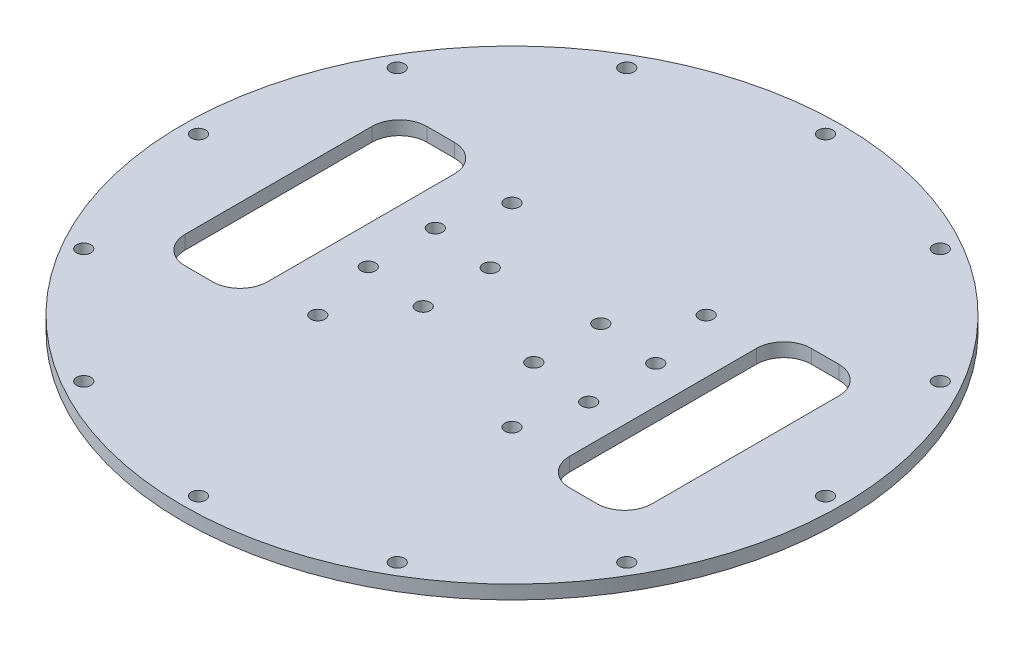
from build123d import *

# Parameters (mm, degrees)
SKETCH1_R      = 152.4
SKETCH1_R_2    = 3.302
EXTRUDE1_DEPTH = 6.35
SKETCH2_R      = 3.302
EXTRUDE3_DEPTH = 216.619670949
SKETCH2_6_R    = 3.302
EXTRUDE4_DEPTH = 216.619670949


with BuildPart() as part:
    # Sketch1 → Extrude1 (new body)
    with BuildSketch(Plane(origin=(0, 0, 0), x_dir=(1, 0, 0), z_dir=(0, 1, 0))):
        with Locations(Location((0, 0, 0), (0, 0, 270))):
            Circle(SKETCH1_R)
        with Locations(Location((-23.98131856, 13.91245376, 0), (0, 0, 270))):
            Circle(SKETCH1_R_2, mode=Mode.SUBTRACT)
        with Locations(Location((-23.98131856, -17.08745376, 0), (0, 0, 270))):
            Circle(SKETCH1_R_2, mode=Mode.SUBTRACT)
        with Locations(Location((-52.55631856, 17.08745376, 0), (0, 0, 270))):
            Circle(SKETCH1_R_2, mode=Mode.SUBTRACT)
        with Locations(Location((-52.55631856, -13.91245376, 0), (0, 0, 270))):
            Circle(SKETCH1_R_2, mode=Mode.SUBTRACT)
        with Locations(Location((23.98131856, -13.91245376, 0), (0, 0, 270))):
            Circle(SKETCH1_R_2, mode=Mode.SUBTRACT)
        with Locations(Location((23.98131856, 17.08745376, 0), (0, 0, 270))):
            Circle(SKETCH1_R_2, mode=Mode.SUBTRACT)
        with Locations(Location((52.55631856, -17.08745376, 0), (0, 0, 270))):
            Circle(SKETCH1_R_2, mode=Mode.SUBTRACT)
        with Locations(Location((52.55631856, 13.91245376, 0), (0, 0, 270))):
            Circle(SKETCH1_R_2, mode=Mode.SUBTRACT)
        with BuildLine():
            Line((-82.55, 55.88), (-95.25, 55.88))
            ThreePointArc((-95.25, 55.88), (-104.230256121, 52.160256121), (-107.95, 43.18))
            Line((-107.95, 43.18), (-107.95, -43.18))
            ThreePointArc((-107.95, -43.18), (-104.230256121, -52.160256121), (-95.25, -55.88))
            Line((-95.25, -55.88), (-82.55, -55.88))
            ThreePointArc((-82.55, -55.88), (-73.569743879, -52.160256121), (-69.85, -43.18))
            Line((-69.85, -43.18), (-69.85, 43.18))
            ThreePointArc((-69.85, 43.18), (-73.569743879, 52.160256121), (-82.55, 55.88))
        make_face(mode=Mode.SUBTRACT)
        with BuildLine():
            Line((69.85, -43.18), (69.85, 43.18))
            ThreePointArc((69.85, 43.18), (73.569743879, 52.160256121), (82.55, 55.88))
            Line((82.55, 55.88), (95.25, 55.88))
            ThreePointArc((95.25, 55.88), (104.230256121, 52.160256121), (107.95, 43.18))
            Line((107.95, 43.18), (107.95, -43.18))
            ThreePointArc((107.95, -43.18), (104.230256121, -52.160256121), (95.25, -55.88))
            Line((95.25, -55.88), (82.55, -55.88))
            ThreePointArc((82.55, -55.88), (73.569743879, -52.160256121), (69.85, -43.18))
        make_face(mode=Mode.SUBTRACT)
    extrude(amount=EXTRUDE1_DEPTH)

    # Sketch2 → Extrude3 (cut, through all)
    with BuildSketch(Plane(origin=(0, 6.35, 0), x_dir=(1, 0, 0), z_dir=(0, 1, 0))):
        with Locations((-44.901280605, 44.901280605)):
            Circle(SKETCH2_R)
        with Locations((44.901280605, 44.901280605)):
            Circle(SKETCH2_R)
        with Locations((44.901280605, -44.901280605)):
            Circle(SKETCH2_R)
        with Locations((-44.901280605, -44.901280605)):
            Circle(SKETCH2_R)
    extrude(amount=-EXTRUDE3_DEPTH, mode=Mode.SUBTRACT)

    # Sketch2_6 → Extrude4 (cut, through all)
    with BuildSketch(Plane(origin=(0, 6.35, 0), x_dir=(1, 0, 0), z_dir=(0, 1, 0))):
        with Locations((-144.980924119, 0)):
            Circle(SKETCH2_6_R)
        with Locations((-125.557163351, 72.490462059)):
            Circle(SKETCH2_6_R)
        with Locations((-72.490462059, 125.557163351)):
            Circle(SKETCH2_6_R)
        with Locations((0, 144.980924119)):
            Circle(SKETCH2_6_R)
        with Locations((72.490462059, 125.557163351)):
            Circle(SKETCH2_6_R)
        with Locations((125.557163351, 72.490462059)):
            Circle(SKETCH2_6_R)
        with Locations((144.980924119, 0)):
            Circle(SKETCH2_6_R)
        with Locations((125.557163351, -72.490462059)):
            Circle(SKETCH2_6_R)
        with Locations((72.490462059, -125.557163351)):
            Circle(SKETCH2_6_R)
        with Locations((0, -144.980924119)):
            Circle(SKETCH2_6_R)
        with Locations((-72.490462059, -125.557163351)):
            Circle(SKETCH2_6_R)
        with Locations((-125.557163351, -72.490462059)):
            Circle(SKETCH2_6_R)
    extrude(amount=-EXTRUDE4_DEPTH, mode=Mode.SUBTRACT)


solid = part.part
